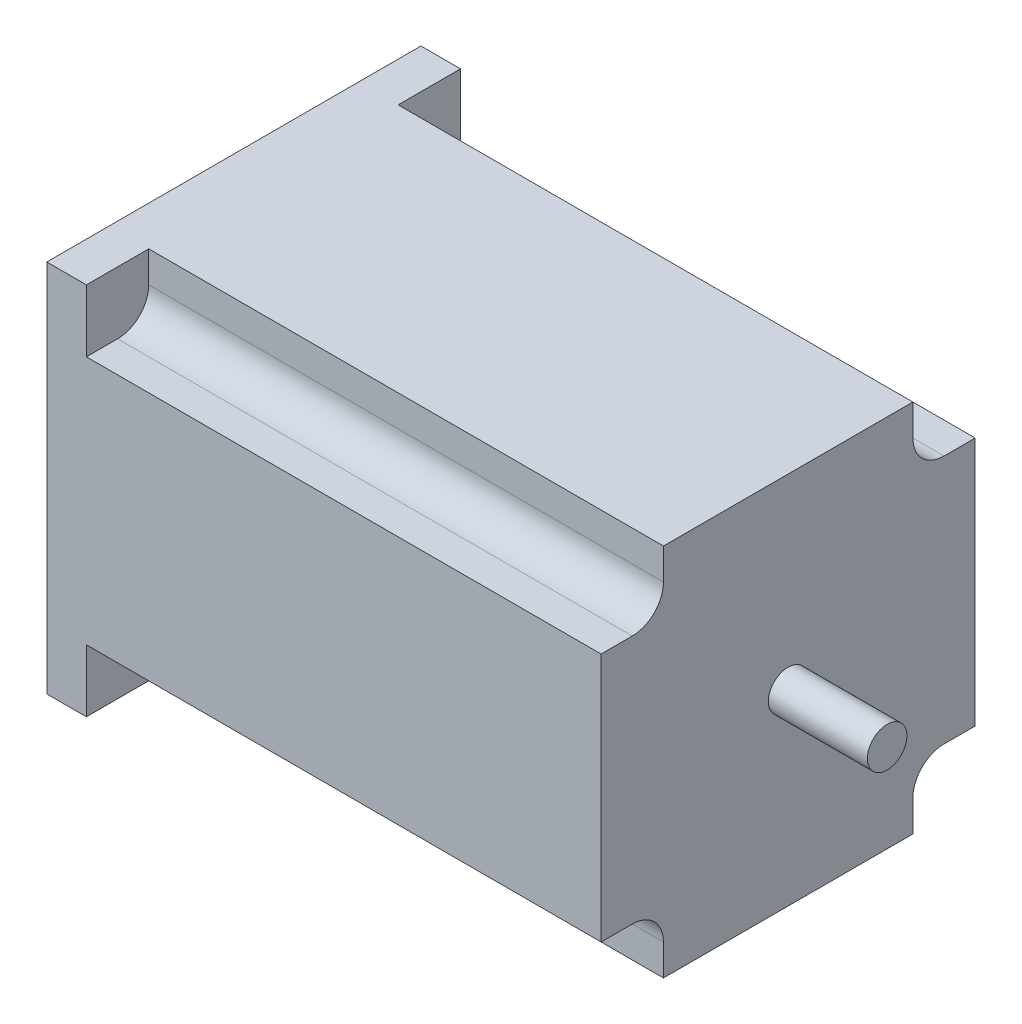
ISO-10303-21;
HEADER;
FILE_DESCRIPTION(('STEP AP214'),'2;1');
FILE_NAME('part.step','',(''),(''),'','','');
FILE_SCHEMA(('AUTOMOTIVE_DESIGN { 1 0 10303 214 1 1 1 1 }'));
ENDSEC;
DATA;
#1=APPLICATION_CONTEXT('core data for automotive mechanical design processes');
#2=APPLICATION_PROTOCOL_DEFINITION('international standard','automotive_design',2000,#1);
#3=PRODUCT_CONTEXT('',#1,'mechanical');
#4=PRODUCT('Part','Part','',(#3));
#5=PRODUCT_RELATED_PRODUCT_CATEGORY('part','',(#4));
#6=PRODUCT_DEFINITION_FORMATION('','',#4);
#7=PRODUCT_DEFINITION_CONTEXT('part definition',#1,'design');
#8=PRODUCT_DEFINITION('design','',#6,#7);
#9=PRODUCT_DEFINITION_SHAPE('','',#8);
#10=(LENGTH_UNIT() NAMED_UNIT(*) SI_UNIT(.MILLI.,.METRE.));
#11=(NAMED_UNIT(*) PLANE_ANGLE_UNIT() SI_UNIT($,.RADIAN.));
#12=(NAMED_UNIT(*) SI_UNIT($,.STERADIAN.) SOLID_ANGLE_UNIT());
#13=UNCERTAINTY_MEASURE_WITH_UNIT(LENGTH_MEASURE(1.E-05),#10,'distance_accuracy_value','');
#14=(GEOMETRIC_REPRESENTATION_CONTEXT(3) GLOBAL_UNCERTAINTY_ASSIGNED_CONTEXT((#13)) GLOBAL_UNIT_ASSIGNED_CONTEXT((#10,
#11,#12)) REPRESENTATION_CONTEXT('',''));
#15=CARTESIAN_POINT('',(0.,0.,0.));
#16=DIRECTION('',(0.,0.,1.));
#17=DIRECTION('',(1.,0.,0.));
#18=AXIS2_PLACEMENT_3D('',#15,#16,#17);
#19=CARTESIAN_POINT('',(88.9,30.,-30.));
#20=DIRECTION('',(1.,0.,0.));
#21=DIRECTION('',(0.,0.,-1.));
#22=AXIS2_PLACEMENT_3D('',#19,#20,#21);
#23=PLANE('',#22);
#24=DIRECTION('',(0.,0.,1.));
#25=VECTOR('',#24,1.);
#26=CARTESIAN_POINT('',(88.9,30.,-30.));
#27=LINE('',#26,#25);
#28=CARTESIAN_POINT('',(88.9,30.,-20.));
#29=VERTEX_POINT('',#28);
#30=CARTESIAN_POINT('',(88.9,30.,20.));
#31=VERTEX_POINT('',#30);
#32=EDGE_CURVE('E307',#29,#31,#27,.T.);
#33=ORIENTED_EDGE('',*,*,#32,.T.);
#34=DIRECTION('',(0.,-1.,0.));
#35=VECTOR('',#34,1.);
#36=CARTESIAN_POINT('',(88.9,30.,20.));
#37=LINE('',#36,#35);
#38=CARTESIAN_POINT('',(88.9,25.,20.));
#39=VERTEX_POINT('',#38);
#40=EDGE_CURVE('E188',#31,#39,#37,.T.);
#41=ORIENTED_EDGE('',*,*,#40,.T.);
#42=CARTESIAN_POINT('',(88.9,25.,25.));
#43=DIRECTION('',(-1.,0.,0.));
#44=DIRECTION('',(0.,0.,-1.));
#45=AXIS2_PLACEMENT_3D('',#42,#43,#44);
#46=CIRCLE('',#45,5.);
#47=CARTESIAN_POINT('',(88.9,20.,25.));
#48=VERTEX_POINT('',#47);
#49=EDGE_CURVE('E377',#39,#48,#46,.T.);
#50=ORIENTED_EDGE('',*,*,#49,.T.);
#51=DIRECTION('',(0.,0.,1.));
#52=VECTOR('',#51,1.);
#53=CARTESIAN_POINT('',(88.9,20.,30.));
#54=LINE('',#53,#52);
#55=CARTESIAN_POINT('',(88.9,20.,30.));
#56=VERTEX_POINT('',#55);
#57=EDGE_CURVE('E375',#48,#56,#54,.T.);
#58=ORIENTED_EDGE('',*,*,#57,.T.);
#59=DIRECTION('',(0.,-1.,0.));
#60=VECTOR('',#59,1.);
#61=CARTESIAN_POINT('',(88.9,30.,30.));
#62=LINE('',#61,#60);
#63=CARTESIAN_POINT('',(88.9,-20.,30.));
#64=VERTEX_POINT('',#63);
#65=EDGE_CURVE('E193',#56,#64,#62,.T.);
#66=ORIENTED_EDGE('',*,*,#65,.T.);
#67=DIRECTION('',(0.,0.,1.));
#68=VECTOR('',#67,1.);
#69=CARTESIAN_POINT('',(88.9,-20.,30.));
#70=LINE('',#69,#68);
#71=CARTESIAN_POINT('',(88.9,-20.,25.));
#72=VERTEX_POINT('',#71);
#73=EDGE_CURVE('E203',#72,#64,#70,.T.);
#74=ORIENTED_EDGE('',*,*,#73,.F.);
#75=CARTESIAN_POINT('',(88.9,-25.,25.));
#76=DIRECTION('',(1.,0.,0.));
#77=DIRECTION('',(0.,0.,-1.));
#78=AXIS2_PLACEMENT_3D('',#75,#76,#77);
#79=CIRCLE('',#78,5.);
#80=CARTESIAN_POINT('',(88.9,-25.,20.));
#81=VERTEX_POINT('',#80);
#82=EDGE_CURVE('E216',#81,#72,#79,.T.);
#83=ORIENTED_EDGE('',*,*,#82,.F.);
#84=DIRECTION('',(0.,1.,0.));
#85=VECTOR('',#84,1.);
#86=CARTESIAN_POINT('',(88.9,-30.,20.));
#87=LINE('',#86,#85);
#88=CARTESIAN_POINT('',(88.9,-30.,20.));
#89=VERTEX_POINT('',#88);
#90=EDGE_CURVE('E213',#89,#81,#87,.T.);
#91=ORIENTED_EDGE('',*,*,#90,.F.);
#92=DIRECTION('',(0.,0.,-1.));
#93=VECTOR('',#92,1.);
#94=CARTESIAN_POINT('',(88.9,-30.,30.));
#95=LINE('',#94,#93);
#96=CARTESIAN_POINT('',(88.9,-30.,-20.));
#97=VERTEX_POINT('',#96);
#98=EDGE_CURVE('E296',#89,#97,#95,.T.);
#99=ORIENTED_EDGE('',*,*,#98,.T.);
#100=DIRECTION('',(0.,1.,0.));
#101=VECTOR('',#100,1.);
#102=CARTESIAN_POINT('',(88.9,-30.,-20.));
#103=LINE('',#102,#101);
#104=CARTESIAN_POINT('',(88.9,-25.,-20.));
#105=VERTEX_POINT('',#104);
#106=EDGE_CURVE('E234',#97,#105,#103,.T.);
#107=ORIENTED_EDGE('',*,*,#106,.T.);
#108=CARTESIAN_POINT('',(88.9,-25.,-25.));
#109=DIRECTION('',(-1.,0.,0.));
#110=DIRECTION('',(0.,0.,1.));
#111=AXIS2_PLACEMENT_3D('',#108,#109,#110);
#112=CIRCLE('',#111,5.);
#113=CARTESIAN_POINT('',(88.9,-20.,-25.));
#114=VERTEX_POINT('',#113);
#115=EDGE_CURVE('E246',#105,#114,#112,.T.);
#116=ORIENTED_EDGE('',*,*,#115,.T.);
#117=DIRECTION('',(0.,0.,-1.));
#118=VECTOR('',#117,1.);
#119=CARTESIAN_POINT('',(88.9,-20.,-30.));
#120=LINE('',#119,#118);
#121=CARTESIAN_POINT('',(88.9,-20.,-30.));
#122=VERTEX_POINT('',#121);
#123=EDGE_CURVE('E224',#114,#122,#120,.T.);
#124=ORIENTED_EDGE('',*,*,#123,.T.);
#125=DIRECTION('',(0.,1.,0.));
#126=VECTOR('',#125,1.);
#127=CARTESIAN_POINT('',(88.9,-30.,-30.));
#128=LINE('',#127,#126);
#129=CARTESIAN_POINT('',(88.9,20.,-30.));
#130=VERTEX_POINT('',#129);
#131=EDGE_CURVE('E286',#122,#130,#128,.T.);
#132=ORIENTED_EDGE('',*,*,#131,.T.);
#133=DIRECTION('',(0.,0.,-1.));
#134=VECTOR('',#133,1.);
#135=CARTESIAN_POINT('',(88.9,20.,-30.));
#136=LINE('',#135,#134);
#137=CARTESIAN_POINT('',(88.9,20.,-25.));
#138=VERTEX_POINT('',#137);
#139=EDGE_CURVE('E263',#138,#130,#136,.T.);
#140=ORIENTED_EDGE('',*,*,#139,.F.);
#141=CARTESIAN_POINT('',(88.9,25.,-25.));
#142=DIRECTION('',(1.,0.,0.));
#143=DIRECTION('',(0.,0.,1.));
#144=AXIS2_PLACEMENT_3D('',#141,#142,#143);
#145=CIRCLE('',#144,5.);
#146=CARTESIAN_POINT('',(88.9,25.,-20.));
#147=VERTEX_POINT('',#146);
#148=EDGE_CURVE('E278',#147,#138,#145,.T.);
#149=ORIENTED_EDGE('',*,*,#148,.F.);
#150=DIRECTION('',(0.,-1.,0.));
#151=VECTOR('',#150,1.);
#152=CARTESIAN_POINT('',(88.9,30.,-20.));
#153=LINE('',#152,#151);
#154=EDGE_CURVE('E254',#29,#147,#153,.T.);
#155=ORIENTED_EDGE('',*,*,#154,.F.);
#156=EDGE_LOOP('',(#33,#41,#50,#58,#66,#74,#83,#91,#99,#107,#116,#124,#132,#140,#149,#155));
#157=FACE_BOUND('',#156,.T.);
#158=CARTESIAN_POINT('',(88.9,0.,0.));
#159=DIRECTION('',(1.,0.,0.));
#160=DIRECTION('',(0.,0.,-1.));
#161=AXIS2_PLACEMENT_3D('',#158,#159,#160);
#162=CIRCLE('',#161,3.175);
#163=CARTESIAN_POINT('',(88.9,0.,-3.175));
#164=VERTEX_POINT('',#163);
#165=EDGE_CURVE('E398',#164,#164,#162,.T.);
#166=ORIENTED_EDGE('',*,*,#165,.F.);
#167=EDGE_LOOP('',(#166));
#168=FACE_BOUND('',#167,.T.);
#169=ADVANCED_FACE('F33',(#157,#168),#23,.T.);
#170=CARTESIAN_POINT('',(-1.5,0.,0.));
#171=DIRECTION('',(1.,0.,0.));
#172=DIRECTION('',(0.,0.,-1.));
#173=AXIS2_PLACEMENT_3D('',#170,#171,#172);
#174=PLANE('',#173);
#175=CARTESIAN_POINT('',(-1.5,0.,0.));
#176=DIRECTION('',(1.,0.,0.));
#177=DIRECTION('',(0.,0.,-1.));
#178=AXIS2_PLACEMENT_3D('',#175,#176,#177);
#179=CIRCLE('',#178,19.05);
#180=CARTESIAN_POINT('',(-1.5,0.,-19.05));
#181=VERTEX_POINT('',#180);
#182=EDGE_CURVE('E378',#181,#181,#179,.T.);
#183=ORIENTED_EDGE('',*,*,#182,.F.);
#184=EDGE_LOOP('',(#183));
#185=FACE_BOUND('',#184,.T.);
#186=CARTESIAN_POINT('',(-1.5,0.,0.));
#187=DIRECTION('',(1.,0.,0.));
#188=DIRECTION('',(0.,0.,-1.));
#189=AXIS2_PLACEMENT_3D('',#186,#187,#188);
#190=CIRCLE('',#189,3.175);
#191=CARTESIAN_POINT('',(-1.5,0.,-3.175));
#192=VERTEX_POINT('',#191);
#193=EDGE_CURVE('E11',#192,#192,#190,.F.);
#194=ORIENTED_EDGE('',*,*,#193,.F.);
#195=EDGE_LOOP('',(#194));
#196=FACE_BOUND('',#195,.T.);
#197=ADVANCED_FACE('F413',(#185,#196),#174,.F.);
#198=CARTESIAN_POINT('',(0.,30.,30.));
#199=DIRECTION('',(0.,0.,1.));
#200=DIRECTION('',(0.,-1.,0.));
#201=AXIS2_PLACEMENT_3D('',#198,#199,#200);
#202=PLANE('',#201);
#203=ORIENTED_EDGE('',*,*,#65,.F.);
#204=DIRECTION('',(1.,0.,0.));
#205=VECTOR('',#204,1.);
#206=CARTESIAN_POINT('',(6.35000000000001,20.,30.));
#207=LINE('',#206,#205);
#208=CARTESIAN_POINT('',(6.35000000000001,20.,30.));
#209=VERTEX_POINT('',#208);
#210=EDGE_CURVE('E176',#209,#56,#207,.T.);
#211=ORIENTED_EDGE('',*,*,#210,.F.);
#212=DIRECTION('',(0.,1.,0.));
#213=VECTOR('',#212,1.);
#214=CARTESIAN_POINT('',(6.35000000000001,30.,30.));
#215=LINE('',#214,#213);
#216=CARTESIAN_POINT('',(6.35000000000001,30.,30.));
#217=VERTEX_POINT('',#216);
#218=EDGE_CURVE('E180',#209,#217,#215,.T.);
#219=ORIENTED_EDGE('',*,*,#218,.T.);
#220=DIRECTION('',(1.,0.,0.));
#221=VECTOR('',#220,1.);
#222=CARTESIAN_POINT('',(0.,30.,30.));
#223=LINE('',#222,#221);
#224=CARTESIAN_POINT('',(0.,30.,30.));
#225=VERTEX_POINT('',#224);
#226=EDGE_CURVE('E317',#225,#217,#223,.T.);
#227=ORIENTED_EDGE('',*,*,#226,.F.);
#228=DIRECTION('',(0.,-1.,0.));
#229=VECTOR('',#228,1.);
#230=CARTESIAN_POINT('',(0.,30.,30.));
#231=LINE('',#230,#229);
#232=CARTESIAN_POINT('',(0.,-30.,30.));
#233=VERTEX_POINT('',#232);
#234=EDGE_CURVE('E299',#225,#233,#231,.T.);
#235=ORIENTED_EDGE('',*,*,#234,.T.);
#236=DIRECTION('',(1.,0.,0.));
#237=VECTOR('',#236,1.);
#238=CARTESIAN_POINT('',(0.,-30.,30.));
#239=LINE('',#238,#237);
#240=CARTESIAN_POINT('',(6.35000000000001,-30.,30.));
#241=VERTEX_POINT('',#240);
#242=EDGE_CURVE('E314',#233,#241,#239,.T.);
#243=ORIENTED_EDGE('',*,*,#242,.T.);
#244=DIRECTION('',(0.,-1.,0.));
#245=VECTOR('',#244,1.);
#246=CARTESIAN_POINT('',(6.35000000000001,-30.,30.));
#247=LINE('',#246,#245);
#248=CARTESIAN_POINT('',(6.35000000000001,-20.,30.));
#249=VERTEX_POINT('',#248);
#250=EDGE_CURVE('E200',#249,#241,#247,.T.);
#251=ORIENTED_EDGE('',*,*,#250,.F.);
#252=DIRECTION('',(1.,0.,0.));
#253=VECTOR('',#252,1.);
#254=CARTESIAN_POINT('',(6.35000000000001,-20.,30.));
#255=LINE('',#254,#253);
#256=EDGE_CURVE('E222',#249,#64,#255,.T.);
#257=ORIENTED_EDGE('',*,*,#256,.T.);
#258=EDGE_LOOP('',(#203,#211,#219,#227,#235,#243,#251,#257));
#259=FACE_BOUND('',#258,.T.);
#260=ADVANCED_FACE('F191',(#259),#202,.T.);
#261=CARTESIAN_POINT('',(0.,30.,-30.));
#262=DIRECTION('',(0.,1.,0.));
#263=DIRECTION('',(0.,0.,1.));
#264=AXIS2_PLACEMENT_3D('',#261,#262,#263);
#265=PLANE('',#264);
#266=DIRECTION('',(0.,0.,-1.));
#267=VECTOR('',#266,1.);
#268=CARTESIAN_POINT('',(6.35000000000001,30.,30.));
#269=LINE('',#268,#267);
#270=CARTESIAN_POINT('',(6.35000000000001,30.,20.));
#271=VERTEX_POINT('',#270);
#272=EDGE_CURVE('E185',#217,#271,#269,.T.);
#273=ORIENTED_EDGE('',*,*,#272,.T.);
#274=DIRECTION('',(1.,0.,0.));
#275=VECTOR('',#274,1.);
#276=CARTESIAN_POINT('',(6.35000000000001,30.,20.));
#277=LINE('',#276,#275);
#278=EDGE_CURVE('E217',#271,#31,#277,.T.);
#279=ORIENTED_EDGE('',*,*,#278,.T.);
#280=ORIENTED_EDGE('',*,*,#32,.F.);
#281=DIRECTION('',(1.,0.,0.));
#282=VECTOR('',#281,1.);
#283=CARTESIAN_POINT('',(6.35000000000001,30.,-20.));
#284=LINE('',#283,#282);
#285=CARTESIAN_POINT('',(6.35000000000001,30.,-20.));
#286=VERTEX_POINT('',#285);
#287=EDGE_CURVE('E275',#286,#29,#284,.T.);
#288=ORIENTED_EDGE('',*,*,#287,.F.);
#289=DIRECTION('',(0.,0.,1.));
#290=VECTOR('',#289,1.);
#291=CARTESIAN_POINT('',(6.35000000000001,30.,-30.));
#292=LINE('',#291,#290);
#293=CARTESIAN_POINT('',(6.35000000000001,30.,-30.));
#294=VERTEX_POINT('',#293);
#295=EDGE_CURVE('E262',#294,#286,#292,.T.);
#296=ORIENTED_EDGE('',*,*,#295,.F.);
#297=DIRECTION('',(1.,0.,0.));
#298=VECTOR('',#297,1.);
#299=CARTESIAN_POINT('',(0.,30.,-30.));
#300=LINE('',#299,#298);
#301=CARTESIAN_POINT('',(0.,30.,-30.));
#302=VERTEX_POINT('',#301);
#303=EDGE_CURVE('E305',#302,#294,#300,.T.);
#304=ORIENTED_EDGE('',*,*,#303,.F.);
#305=DIRECTION('',(0.,0.,1.));
#306=VECTOR('',#305,1.);
#307=CARTESIAN_POINT('',(0.,30.,-30.));
#308=LINE('',#307,#306);
#309=EDGE_CURVE('E295',#302,#225,#308,.T.);
#310=ORIENTED_EDGE('',*,*,#309,.T.);
#311=ORIENTED_EDGE('',*,*,#226,.T.);
#312=EDGE_LOOP('',(#273,#279,#280,#288,#296,#304,#310,#311));
#313=FACE_BOUND('',#312,.T.);
#314=ADVANCED_FACE('F326',(#313),#265,.T.);
#315=CARTESIAN_POINT('',(0.,-30.,-30.));
#316=DIRECTION('',(0.,0.,-1.));
#317=DIRECTION('',(-1.,0.,0.));
#318=AXIS2_PLACEMENT_3D('',#315,#316,#317);
#319=PLANE('',#318);
#320=ORIENTED_EDGE('',*,*,#131,.F.);
#321=DIRECTION('',(1.,0.,0.));
#322=VECTOR('',#321,1.);
#323=CARTESIAN_POINT('',(6.35000000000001,-20.,-30.));
#324=LINE('',#323,#322);
#325=CARTESIAN_POINT('',(6.35000000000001,-20.,-30.));
#326=VERTEX_POINT('',#325);
#327=EDGE_CURVE('E243',#326,#122,#324,.T.);
#328=ORIENTED_EDGE('',*,*,#327,.F.);
#329=DIRECTION('',(0.,-1.,0.));
#330=VECTOR('',#329,1.);
#331=CARTESIAN_POINT('',(6.35000000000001,-30.,-30.));
#332=LINE('',#331,#330);
#333=CARTESIAN_POINT('',(6.35000000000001,-30.,-30.));
#334=VERTEX_POINT('',#333);
#335=EDGE_CURVE('E230',#326,#334,#332,.T.);
#336=ORIENTED_EDGE('',*,*,#335,.T.);
#337=DIRECTION('',(1.,0.,0.));
#338=VECTOR('',#337,1.);
#339=CARTESIAN_POINT('',(0.,-30.,-30.));
#340=LINE('',#339,#338);
#341=CARTESIAN_POINT('',(0.,-30.,-30.));
#342=VERTEX_POINT('',#341);
#343=EDGE_CURVE('E41',#342,#334,#340,.T.);
#344=ORIENTED_EDGE('',*,*,#343,.F.);
#345=DIRECTION('',(0.,1.,0.));
#346=VECTOR('',#345,1.);
#347=CARTESIAN_POINT('',(0.,-30.,-30.));
#348=LINE('',#347,#346);
#349=EDGE_CURVE('E292',#342,#302,#348,.T.);
#350=ORIENTED_EDGE('',*,*,#349,.T.);
#351=ORIENTED_EDGE('',*,*,#303,.T.);
#352=DIRECTION('',(0.,1.,0.));
#353=VECTOR('',#352,1.);
#354=CARTESIAN_POINT('',(6.35000000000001,30.,-30.));
#355=LINE('',#354,#353);
#356=CARTESIAN_POINT('',(6.35000000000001,20.,-30.));
#357=VERTEX_POINT('',#356);
#358=EDGE_CURVE('E260',#357,#294,#355,.T.);
#359=ORIENTED_EDGE('',*,*,#358,.F.);
#360=DIRECTION('',(1.,0.,0.));
#361=VECTOR('',#360,1.);
#362=CARTESIAN_POINT('',(6.35000000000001,20.,-30.));
#363=LINE('',#362,#361);
#364=EDGE_CURVE('E283',#357,#130,#363,.T.);
#365=ORIENTED_EDGE('',*,*,#364,.T.);
#366=EDGE_LOOP('',(#320,#328,#336,#344,#350,#351,#359,#365));
#367=FACE_BOUND('',#366,.T.);
#368=ADVANCED_FACE('F35',(#367),#319,.T.);
#369=CARTESIAN_POINT('',(0.,-30.,30.));
#370=DIRECTION('',(0.,-1.,0.));
#371=DIRECTION('',(0.,0.,-1.));
#372=AXIS2_PLACEMENT_3D('',#369,#370,#371);
#373=PLANE('',#372);
#374=DIRECTION('',(1.,0.,0.));
#375=VECTOR('',#374,1.);
#376=CARTESIAN_POINT('',(6.35000000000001,-30.,20.));
#377=LINE('',#376,#375);
#378=CARTESIAN_POINT('',(6.35000000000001,-30.,20.));
#379=VERTEX_POINT('',#378);
#380=EDGE_CURVE('E212',#379,#89,#377,.T.);
#381=ORIENTED_EDGE('',*,*,#380,.F.);
#382=DIRECTION('',(0.,0.,-1.));
#383=VECTOR('',#382,1.);
#384=CARTESIAN_POINT('',(6.35000000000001,-30.,30.));
#385=LINE('',#384,#383);
#386=EDGE_CURVE('E202',#241,#379,#385,.T.);
#387=ORIENTED_EDGE('',*,*,#386,.F.);
#388=ORIENTED_EDGE('',*,*,#242,.F.);
#389=DIRECTION('',(0.,0.,-1.));
#390=VECTOR('',#389,1.);
#391=CARTESIAN_POINT('',(0.,-30.,30.));
#392=LINE('',#391,#390);
#393=EDGE_CURVE('E302',#233,#342,#392,.T.);
#394=ORIENTED_EDGE('',*,*,#393,.T.);
#395=ORIENTED_EDGE('',*,*,#343,.T.);
#396=DIRECTION('',(0.,0.,1.));
#397=VECTOR('',#396,1.);
#398=CARTESIAN_POINT('',(6.35000000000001,-30.,-30.));
#399=LINE('',#398,#397);
#400=CARTESIAN_POINT('',(6.35000000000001,-30.,-20.));
#401=VERTEX_POINT('',#400);
#402=EDGE_CURVE('E240',#334,#401,#399,.T.);
#403=ORIENTED_EDGE('',*,*,#402,.T.);
#404=DIRECTION('',(1.,0.,0.));
#405=VECTOR('',#404,1.);
#406=CARTESIAN_POINT('',(6.35000000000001,-30.,-20.));
#407=LINE('',#406,#405);
#408=EDGE_CURVE('E251',#401,#97,#407,.T.);
#409=ORIENTED_EDGE('',*,*,#408,.T.);
#410=ORIENTED_EDGE('',*,*,#98,.F.);
#411=EDGE_LOOP('',(#381,#387,#388,#394,#395,#403,#409,#410));
#412=FACE_BOUND('',#411,.T.);
#413=ADVANCED_FACE('F366',(#412),#373,.T.);
#414=CARTESIAN_POINT('',(0.,30.,-30.));
#415=DIRECTION('',(1.,0.,0.));
#416=DIRECTION('',(0.,0.,-1.));
#417=AXIS2_PLACEMENT_3D('',#414,#415,#416);
#418=PLANE('',#417);
#419=CARTESIAN_POINT('',(0.,0.,0.));
#420=DIRECTION('',(1.,0.,0.));
#421=DIRECTION('',(0.,0.,-1.));
#422=AXIS2_PLACEMENT_3D('',#419,#420,#421);
#423=CIRCLE('',#422,19.05);
#424=CARTESIAN_POINT('',(0.,0.,-19.05));
#425=VERTEX_POINT('',#424);
#426=EDGE_CURVE('E382',#425,#425,#423,.T.);
#427=ORIENTED_EDGE('',*,*,#426,.T.);
#428=EDGE_LOOP('',(#427));
#429=FACE_BOUND('',#428,.T.);
#430=ORIENTED_EDGE('',*,*,#349,.F.);
#431=ORIENTED_EDGE('',*,*,#393,.F.);
#432=ORIENTED_EDGE('',*,*,#234,.F.);
#433=ORIENTED_EDGE('',*,*,#309,.F.);
#434=EDGE_LOOP('',(#430,#431,#432,#433));
#435=FACE_BOUND('',#434,.T.);
#436=ADVANCED_FACE('F330',(#429,#435),#418,.F.);
#437=CARTESIAN_POINT('',(6.35000000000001,20.,-30.));
#438=DIRECTION('',(0.,-1.,0.));
#439=DIRECTION('',(0.,0.,-1.));
#440=AXIS2_PLACEMENT_3D('',#437,#438,#439);
#441=PLANE('',#440);
#442=ORIENTED_EDGE('',*,*,#139,.T.);
#443=ORIENTED_EDGE('',*,*,#364,.F.);
#444=DIRECTION('',(0.,0.,-1.));
#445=VECTOR('',#444,1.);
#446=CARTESIAN_POINT('',(6.35000000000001,20.,-30.));
#447=LINE('',#446,#445);
#448=CARTESIAN_POINT('',(6.35000000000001,20.,-25.));
#449=VERTEX_POINT('',#448);
#450=EDGE_CURVE('E272',#449,#357,#447,.T.);
#451=ORIENTED_EDGE('',*,*,#450,.F.);
#452=DIRECTION('',(1.,0.,0.));
#453=VECTOR('',#452,1.);
#454=CARTESIAN_POINT('',(6.35000000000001,20.,-25.));
#455=LINE('',#454,#453);
#456=EDGE_CURVE('E287',#449,#138,#455,.T.);
#457=ORIENTED_EDGE('',*,*,#456,.T.);
#458=EDGE_LOOP('',(#442,#443,#451,#457));
#459=FACE_BOUND('',#458,.T.);
#460=ADVANCED_FACE('F351',(#459),#441,.F.);
#461=CARTESIAN_POINT('',(6.35000000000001,25.,-25.));
#462=DIRECTION('',(1.,0.,0.));
#463=DIRECTION('',(0.,0.,-1.));
#464=AXIS2_PLACEMENT_3D('',#461,#462,#463);
#465=CYLINDRICAL_SURFACE('',#464,5.);
#466=ORIENTED_EDGE('',*,*,#148,.T.);
#467=ORIENTED_EDGE('',*,*,#456,.F.);
#468=CARTESIAN_POINT('',(6.35000000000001,25.,-25.));
#469=DIRECTION('',(1.,0.,0.));
#470=DIRECTION('',(0.,0.,1.));
#471=AXIS2_PLACEMENT_3D('',#468,#469,#470);
#472=CIRCLE('',#471,5.);
#473=CARTESIAN_POINT('',(6.35000000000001,25.,-20.));
#474=VERTEX_POINT('',#473);
#475=EDGE_CURVE('E269',#474,#449,#472,.T.);
#476=ORIENTED_EDGE('',*,*,#475,.F.);
#477=DIRECTION('',(1.,0.,0.));
#478=VECTOR('',#477,1.);
#479=CARTESIAN_POINT('',(6.35000000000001,25.,-20.));
#480=LINE('',#479,#478);
#481=EDGE_CURVE('E289',#474,#147,#480,.T.);
#482=ORIENTED_EDGE('',*,*,#481,.T.);
#483=EDGE_LOOP('',(#466,#467,#476,#482));
#484=FACE_BOUND('',#483,.T.);
#485=ADVANCED_FACE('F453',(#484),#465,.F.);
#486=CARTESIAN_POINT('',(6.35000000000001,30.,-20.));
#487=DIRECTION('',(0.,0.,1.));
#488=DIRECTION('',(1.,0.,0.));
#489=AXIS2_PLACEMENT_3D('',#486,#487,#488);
#490=PLANE('',#489);
#491=ORIENTED_EDGE('',*,*,#154,.T.);
#492=ORIENTED_EDGE('',*,*,#481,.F.);
#493=DIRECTION('',(0.,-1.,0.));
#494=VECTOR('',#493,1.);
#495=CARTESIAN_POINT('',(6.35000000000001,30.,-20.));
#496=LINE('',#495,#494);
#497=EDGE_CURVE('E266',#286,#474,#496,.T.);
#498=ORIENTED_EDGE('',*,*,#497,.F.);
#499=ORIENTED_EDGE('',*,*,#287,.T.);
#500=EDGE_LOOP('',(#491,#492,#498,#499));
#501=FACE_BOUND('',#500,.T.);
#502=ADVANCED_FACE('F345',(#501),#490,.F.);
#503=CARTESIAN_POINT('',(6.35000000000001,25.,-25.));
#504=DIRECTION('',(-1.,0.,0.));
#505=DIRECTION('',(0.,0.,1.));
#506=AXIS2_PLACEMENT_3D('',#503,#504,#505);
#507=PLANE('',#506);
#508=ORIENTED_EDGE('',*,*,#358,.T.);
#509=ORIENTED_EDGE('',*,*,#295,.T.);
#510=ORIENTED_EDGE('',*,*,#497,.T.);
#511=ORIENTED_EDGE('',*,*,#475,.T.);
#512=ORIENTED_EDGE('',*,*,#450,.T.);
#513=EDGE_LOOP('',(#508,#509,#510,#511,#512));
#514=FACE_BOUND('',#513,.T.);
#515=ADVANCED_FACE('F348',(#514),#507,.F.);
#516=CARTESIAN_POINT('',(6.35000000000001,-30.,-20.));
#517=DIRECTION('',(0.,0.,-1.));
#518=DIRECTION('',(-1.,0.,0.));
#519=AXIS2_PLACEMENT_3D('',#516,#517,#518);
#520=PLANE('',#519);
#521=ORIENTED_EDGE('',*,*,#106,.F.);
#522=ORIENTED_EDGE('',*,*,#408,.F.);
#523=DIRECTION('',(0.,1.,0.));
#524=VECTOR('',#523,1.);
#525=CARTESIAN_POINT('',(6.35000000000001,-30.,-20.));
#526=LINE('',#525,#524);
#527=CARTESIAN_POINT('',(6.35000000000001,-25.,-20.));
#528=VERTEX_POINT('',#527);
#529=EDGE_CURVE('E238',#401,#528,#526,.T.);
#530=ORIENTED_EDGE('',*,*,#529,.T.);
#531=DIRECTION('',(1.,0.,0.));
#532=VECTOR('',#531,1.);
#533=CARTESIAN_POINT('',(6.35000000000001,-25.,-20.));
#534=LINE('',#533,#532);
#535=EDGE_CURVE('E255',#528,#105,#534,.T.);
#536=ORIENTED_EDGE('',*,*,#535,.T.);
#537=EDGE_LOOP('',(#521,#522,#530,#536));
#538=FACE_BOUND('',#537,.T.);
#539=ADVANCED_FACE('F471',(#538),#520,.T.);
#540=CARTESIAN_POINT('',(6.35000000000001,-25.,-25.));
#541=DIRECTION('',(1.,0.,0.));
#542=DIRECTION('',(0.,0.,-1.));
#543=AXIS2_PLACEMENT_3D('',#540,#541,#542);
#544=CYLINDRICAL_SURFACE('',#543,5.);
#545=ORIENTED_EDGE('',*,*,#115,.F.);
#546=ORIENTED_EDGE('',*,*,#535,.F.);
#547=CARTESIAN_POINT('',(6.35000000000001,-25.,-25.));
#548=DIRECTION('',(-1.,0.,0.));
#549=DIRECTION('',(0.,0.,1.));
#550=AXIS2_PLACEMENT_3D('',#547,#548,#549);
#551=CIRCLE('',#550,5.);
#552=CARTESIAN_POINT('',(6.35000000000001,-20.,-25.));
#553=VERTEX_POINT('',#552);
#554=EDGE_CURVE('E236',#528,#553,#551,.T.);
#555=ORIENTED_EDGE('',*,*,#554,.T.);
#556=DIRECTION('',(1.,0.,0.));
#557=VECTOR('',#556,1.);
#558=CARTESIAN_POINT('',(6.35000000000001,-20.,-25.));
#559=LINE('',#558,#557);
#560=EDGE_CURVE('E257',#553,#114,#559,.T.);
#561=ORIENTED_EDGE('',*,*,#560,.T.);
#562=EDGE_LOOP('',(#545,#546,#555,#561));
#563=FACE_BOUND('',#562,.T.);
#564=ADVANCED_FACE('F477',(#563),#544,.F.);
#565=CARTESIAN_POINT('',(6.35000000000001,-20.,-30.));
#566=DIRECTION('',(0.,-1.,0.));
#567=DIRECTION('',(0.,0.,-1.));
#568=AXIS2_PLACEMENT_3D('',#565,#566,#567);
#569=PLANE('',#568);
#570=ORIENTED_EDGE('',*,*,#123,.F.);
#571=ORIENTED_EDGE('',*,*,#560,.F.);
#572=DIRECTION('',(0.,0.,-1.));
#573=VECTOR('',#572,1.);
#574=CARTESIAN_POINT('',(6.35000000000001,-20.,-30.));
#575=LINE('',#574,#573);
#576=EDGE_CURVE('E233',#553,#326,#575,.T.);
#577=ORIENTED_EDGE('',*,*,#576,.T.);
#578=ORIENTED_EDGE('',*,*,#327,.T.);
#579=EDGE_LOOP('',(#570,#571,#577,#578));
#580=FACE_BOUND('',#579,.T.);
#581=ADVANCED_FACE('F357',(#580),#569,.T.);
#582=CARTESIAN_POINT('',(6.35000000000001,-25.,-25.));
#583=DIRECTION('',(-1.,0.,0.));
#584=DIRECTION('',(0.,0.,1.));
#585=AXIS2_PLACEMENT_3D('',#582,#583,#584);
#586=PLANE('',#585);
#587=ORIENTED_EDGE('',*,*,#335,.F.);
#588=ORIENTED_EDGE('',*,*,#576,.F.);
#589=ORIENTED_EDGE('',*,*,#554,.F.);
#590=ORIENTED_EDGE('',*,*,#529,.F.);
#591=ORIENTED_EDGE('',*,*,#402,.F.);
#592=EDGE_LOOP('',(#587,#588,#589,#590,#591));
#593=FACE_BOUND('',#592,.T.);
#594=ADVANCED_FACE('F362',(#593),#586,.F.);
#595=CARTESIAN_POINT('',(6.35000000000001,-20.,30.));
#596=DIRECTION('',(0.,1.,0.));
#597=DIRECTION('',(0.,0.,1.));
#598=AXIS2_PLACEMENT_3D('',#595,#596,#597);
#599=PLANE('',#598);
#600=ORIENTED_EDGE('',*,*,#73,.T.);
#601=ORIENTED_EDGE('',*,*,#256,.F.);
#602=DIRECTION('',(0.,0.,1.));
#603=VECTOR('',#602,1.);
#604=CARTESIAN_POINT('',(6.35000000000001,-20.,30.));
#605=LINE('',#604,#603);
#606=CARTESIAN_POINT('',(6.35000000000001,-20.,25.));
#607=VERTEX_POINT('',#606);
#608=EDGE_CURVE('E56',#607,#249,#605,.T.);
#609=ORIENTED_EDGE('',*,*,#608,.F.);
#610=DIRECTION('',(1.,0.,0.));
#611=VECTOR('',#610,1.);
#612=CARTESIAN_POINT('',(6.35000000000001,-20.,25.));
#613=LINE('',#612,#611);
#614=EDGE_CURVE('E225',#607,#72,#613,.T.);
#615=ORIENTED_EDGE('',*,*,#614,.T.);
#616=EDGE_LOOP('',(#600,#601,#609,#615));
#617=FACE_BOUND('',#616,.T.);
#618=ADVANCED_FACE('F371',(#617),#599,.F.);
#619=CARTESIAN_POINT('',(6.35000000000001,-25.,25.));
#620=DIRECTION('',(1.,0.,0.));
#621=DIRECTION('',(0.,0.,-1.));
#622=AXIS2_PLACEMENT_3D('',#619,#620,#621);
#623=CYLINDRICAL_SURFACE('',#622,5.);
#624=ORIENTED_EDGE('',*,*,#82,.T.);
#625=ORIENTED_EDGE('',*,*,#614,.F.);
#626=CARTESIAN_POINT('',(6.35000000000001,-25.,25.));
#627=DIRECTION('',(1.,0.,0.));
#628=DIRECTION('',(0.,0.,-1.));
#629=AXIS2_PLACEMENT_3D('',#626,#627,#628);
#630=CIRCLE('',#629,5.);
#631=CARTESIAN_POINT('',(6.35000000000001,-25.,20.));
#632=VERTEX_POINT('',#631);
#633=EDGE_CURVE('E209',#632,#607,#630,.T.);
#634=ORIENTED_EDGE('',*,*,#633,.F.);
#635=DIRECTION('',(1.,0.,0.));
#636=VECTOR('',#635,1.);
#637=CARTESIAN_POINT('',(6.35000000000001,-25.,20.));
#638=LINE('',#637,#636);
#639=EDGE_CURVE('E227',#632,#81,#638,.T.);
#640=ORIENTED_EDGE('',*,*,#639,.T.);
#641=EDGE_LOOP('',(#624,#625,#634,#640));
#642=FACE_BOUND('',#641,.T.);
#643=ADVANCED_FACE('F504',(#642),#623,.F.);
#644=CARTESIAN_POINT('',(6.35000000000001,-30.,20.));
#645=DIRECTION('',(0.,0.,-1.));
#646=DIRECTION('',(-1.,0.,0.));
#647=AXIS2_PLACEMENT_3D('',#644,#645,#646);
#648=PLANE('',#647);
#649=ORIENTED_EDGE('',*,*,#90,.T.);
#650=ORIENTED_EDGE('',*,*,#639,.F.);
#651=DIRECTION('',(0.,1.,0.));
#652=VECTOR('',#651,1.);
#653=CARTESIAN_POINT('',(6.35000000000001,-30.,20.));
#654=LINE('',#653,#652);
#655=EDGE_CURVE('E206',#379,#632,#654,.T.);
#656=ORIENTED_EDGE('',*,*,#655,.F.);
#657=ORIENTED_EDGE('',*,*,#380,.T.);
#658=EDGE_LOOP('',(#649,#650,#656,#657));
#659=FACE_BOUND('',#658,.T.);
#660=ADVANCED_FACE('F511',(#659),#648,.F.);
#661=CARTESIAN_POINT('',(6.35000000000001,-25.,25.));
#662=DIRECTION('',(-1.,0.,0.));
#663=DIRECTION('',(0.,0.,-1.));
#664=AXIS2_PLACEMENT_3D('',#661,#662,#663);
#665=PLANE('',#664);
#666=ORIENTED_EDGE('',*,*,#250,.T.);
#667=ORIENTED_EDGE('',*,*,#386,.T.);
#668=ORIENTED_EDGE('',*,*,#655,.T.);
#669=ORIENTED_EDGE('',*,*,#633,.T.);
#670=ORIENTED_EDGE('',*,*,#608,.T.);
#671=EDGE_LOOP('',(#666,#667,#668,#669,#670));
#672=FACE_BOUND('',#671,.T.);
#673=ADVANCED_FACE('F369',(#672),#665,.F.);
#674=CARTESIAN_POINT('',(6.35000000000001,30.,20.));
#675=DIRECTION('',(0.,0.,1.));
#676=DIRECTION('',(1.,0.,0.));
#677=AXIS2_PLACEMENT_3D('',#674,#675,#676);
#678=PLANE('',#677);
#679=ORIENTED_EDGE('',*,*,#40,.F.);
#680=ORIENTED_EDGE('',*,*,#278,.F.);
#681=DIRECTION('',(0.,-1.,0.));
#682=VECTOR('',#681,1.);
#683=CARTESIAN_POINT('',(6.35000000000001,30.,20.));
#684=LINE('',#683,#682);
#685=CARTESIAN_POINT('',(6.35000000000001,25.,20.));
#686=VERTEX_POINT('',#685);
#687=EDGE_CURVE('E48',#271,#686,#684,.T.);
#688=ORIENTED_EDGE('',*,*,#687,.T.);
#689=DIRECTION('',(1.,0.,0.));
#690=VECTOR('',#689,1.);
#691=CARTESIAN_POINT('',(6.35000000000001,25.,20.));
#692=LINE('',#691,#690);
#693=EDGE_CURVE('E195',#686,#39,#692,.T.);
#694=ORIENTED_EDGE('',*,*,#693,.T.);
#695=EDGE_LOOP('',(#679,#680,#688,#694));
#696=FACE_BOUND('',#695,.T.);
#697=ADVANCED_FACE('F387',(#696),#678,.T.);
#698=CARTESIAN_POINT('',(6.35000000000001,25.,25.));
#699=DIRECTION('',(1.,0.,0.));
#700=DIRECTION('',(0.,0.,-1.));
#701=AXIS2_PLACEMENT_3D('',#698,#699,#700);
#702=CYLINDRICAL_SURFACE('',#701,5.);
#703=ORIENTED_EDGE('',*,*,#49,.F.);
#704=ORIENTED_EDGE('',*,*,#693,.F.);
#705=CARTESIAN_POINT('',(6.35000000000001,25.,25.));
#706=DIRECTION('',(-1.,0.,0.));
#707=DIRECTION('',(0.,0.,-1.));
#708=AXIS2_PLACEMENT_3D('',#705,#706,#707);
#709=CIRCLE('',#708,5.);
#710=CARTESIAN_POINT('',(6.35000000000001,20.,25.));
#711=VERTEX_POINT('',#710);
#712=EDGE_CURVE('E179',#686,#711,#709,.T.);
#713=ORIENTED_EDGE('',*,*,#712,.T.);
#714=DIRECTION('',(1.,0.,0.));
#715=VECTOR('',#714,1.);
#716=CARTESIAN_POINT('',(6.35000000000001,20.,25.));
#717=LINE('',#716,#715);
#718=EDGE_CURVE('E178',#711,#48,#717,.T.);
#719=ORIENTED_EDGE('',*,*,#718,.T.);
#720=EDGE_LOOP('',(#703,#704,#713,#719));
#721=FACE_BOUND('',#720,.T.);
#722=ADVANCED_FACE('F389',(#721),#702,.F.);
#723=CARTESIAN_POINT('',(6.35000000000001,20.,30.));
#724=DIRECTION('',(0.,1.,0.));
#725=DIRECTION('',(0.,0.,1.));
#726=AXIS2_PLACEMENT_3D('',#723,#724,#725);
#727=PLANE('',#726);
#728=ORIENTED_EDGE('',*,*,#57,.F.);
#729=ORIENTED_EDGE('',*,*,#718,.F.);
#730=DIRECTION('',(0.,0.,1.));
#731=VECTOR('',#730,1.);
#732=CARTESIAN_POINT('',(6.35000000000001,20.,30.));
#733=LINE('',#732,#731);
#734=EDGE_CURVE('E171',#711,#209,#733,.T.);
#735=ORIENTED_EDGE('',*,*,#734,.T.);
#736=ORIENTED_EDGE('',*,*,#210,.T.);
#737=EDGE_LOOP('',(#728,#729,#735,#736));
#738=FACE_BOUND('',#737,.T.);
#739=ADVANCED_FACE('F174',(#738),#727,.T.);
#740=CARTESIAN_POINT('',(6.35000000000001,25.,25.));
#741=DIRECTION('',(-1.,0.,0.));
#742=DIRECTION('',(0.,0.,-1.));
#743=AXIS2_PLACEMENT_3D('',#740,#741,#742);
#744=PLANE('',#743);
#745=ORIENTED_EDGE('',*,*,#218,.F.);
#746=ORIENTED_EDGE('',*,*,#734,.F.);
#747=ORIENTED_EDGE('',*,*,#712,.F.);
#748=ORIENTED_EDGE('',*,*,#687,.F.);
#749=ORIENTED_EDGE('',*,*,#272,.F.);
#750=EDGE_LOOP('',(#745,#746,#747,#748,#749));
#751=FACE_BOUND('',#750,.T.);
#752=ADVANCED_FACE('F183',(#751),#744,.F.);
#753=CARTESIAN_POINT('',(-1.5,0.,0.));
#754=DIRECTION('',(1.,0.,0.));
#755=DIRECTION('',(0.,0.,-1.));
#756=AXIS2_PLACEMENT_3D('',#753,#754,#755);
#757=CYLINDRICAL_SURFACE('',#756,19.05);
#758=ORIENTED_EDGE('',*,*,#182,.T.);
#759=EDGE_LOOP('',(#758));
#760=FACE_BOUND('',#759,.T.);
#761=ORIENTED_EDGE('',*,*,#426,.F.);
#762=EDGE_LOOP('',(#761));
#763=FACE_BOUND('',#762,.T.);
#764=ADVANCED_FACE('F549',(#760,#763),#757,.T.);
#765=CARTESIAN_POINT('',(-23.725,0.,0.));
#766=DIRECTION('',(1.,0.,0.));
#767=DIRECTION('',(0.,0.,-1.));
#768=AXIS2_PLACEMENT_3D('',#765,#766,#767);
#769=CYLINDRICAL_SURFACE('',#768,3.175);
#770=CARTESIAN_POINT('',(-23.725,0.,0.));
#771=DIRECTION('',(-1.,0.,0.));
#772=DIRECTION('',(0.,0.,1.));
#773=AXIS2_PLACEMENT_3D('',#770,#771,#772);
#774=CIRCLE('',#773,3.175);
#775=CARTESIAN_POINT('',(-23.725,0.,3.175));
#776=VERTEX_POINT('',#775);
#777=EDGE_CURVE('E393',#776,#776,#774,.T.);
#778=ORIENTED_EDGE('',*,*,#777,.F.);
#779=EDGE_LOOP('',(#778));
#780=FACE_BOUND('',#779,.T.);
#781=ORIENTED_EDGE('',*,*,#193,.T.);
#782=EDGE_LOOP('',(#781));
#783=FACE_BOUND('',#782,.T.);
#784=ADVANCED_FACE('F555',(#780,#783),#769,.T.);
#785=CARTESIAN_POINT('',(-23.725,0.,0.));
#786=DIRECTION('',(-1.,0.,0.));
#787=DIRECTION('',(0.,0.,1.));
#788=AXIS2_PLACEMENT_3D('',#785,#786,#787);
#789=PLANE('',#788);
#790=ORIENTED_EDGE('',*,*,#777,.T.);
#791=EDGE_LOOP('',(#790));
#792=FACE_BOUND('',#791,.T.);
#793=ADVANCED_FACE('F409',(#792),#789,.T.);
#794=CARTESIAN_POINT('',(104.775,0.,0.));
#795=DIRECTION('',(-1.,0.,0.));
#796=DIRECTION('',(0.,0.,1.));
#797=AXIS2_PLACEMENT_3D('',#794,#795,#796);
#798=CYLINDRICAL_SURFACE('',#797,3.175);
#799=CARTESIAN_POINT('',(104.775,0.,0.));
#800=DIRECTION('',(1.,0.,0.));
#801=DIRECTION('',(0.,0.,-1.));
#802=AXIS2_PLACEMENT_3D('',#799,#800,#801);
#803=CIRCLE('',#802,3.175);
#804=CARTESIAN_POINT('',(104.775,0.,-3.175));
#805=VERTEX_POINT('',#804);
#806=EDGE_CURVE('E397',#805,#805,#803,.T.);
#807=ORIENTED_EDGE('',*,*,#806,.F.);
#808=EDGE_LOOP('',(#807));
#809=FACE_BOUND('',#808,.T.);
#810=ORIENTED_EDGE('',*,*,#165,.T.);
#811=EDGE_LOOP('',(#810));
#812=FACE_BOUND('',#811,.T.);
#813=ADVANCED_FACE('F406',(#809,#812),#798,.T.);
#814=CARTESIAN_POINT('',(104.775,0.,0.));
#815=DIRECTION('',(1.,0.,0.));
#816=DIRECTION('',(0.,0.,-1.));
#817=AXIS2_PLACEMENT_3D('',#814,#815,#816);
#818=PLANE('',#817);
#819=ORIENTED_EDGE('',*,*,#806,.T.);
#820=EDGE_LOOP('',(#819));
#821=FACE_BOUND('',#820,.T.);
#822=ADVANCED_FACE('F404',(#821),#818,.T.);
#823=CLOSED_SHELL('',(#169,#197,#260,#314,#368,#413,#436,#460,#485,#502,#515,#539,#564,#581,
#594,#618,#643,#660,#673,#697,#722,#739,#752,#764,#784,#793,#813,#822));
#824=MANIFOLD_SOLID_BREP('B2',#823);
#825=ADVANCED_BREP_SHAPE_REPRESENTATION('',(#18,#824),#14);
#826=SHAPE_DEFINITION_REPRESENTATION(#9,#825);
ENDSEC;
END-ISO-10303-21;
